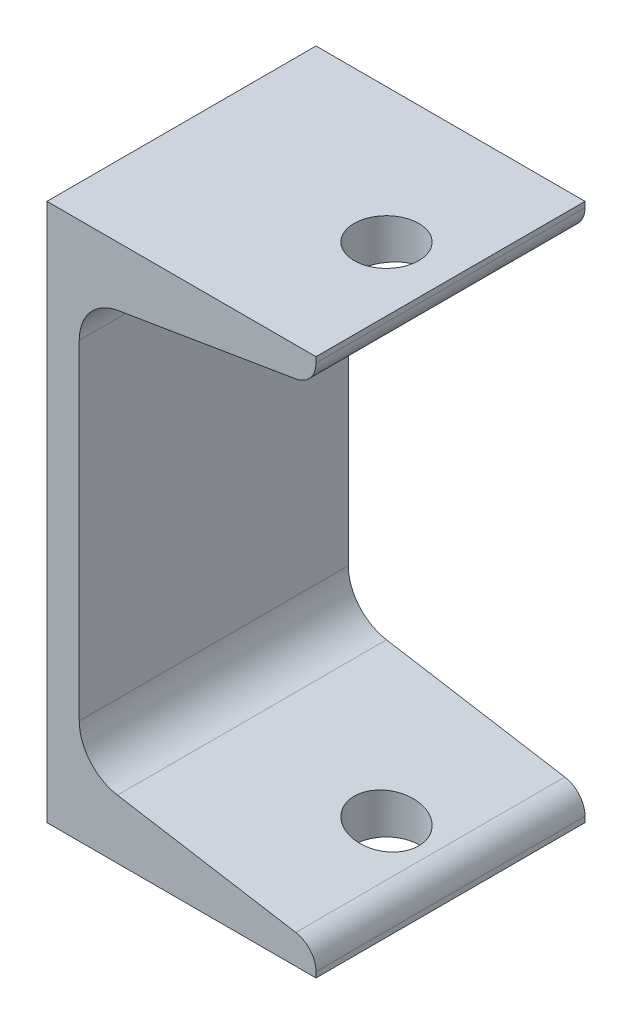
ISO-10303-21;
HEADER;
FILE_DESCRIPTION(('STEP AP214'),'2;1');
FILE_NAME('part.step','',(''),(''),'','','');
FILE_SCHEMA(('AUTOMOTIVE_DESIGN { 1 0 10303 214 1 1 1 1 }'));
ENDSEC;
DATA;
#1=APPLICATION_CONTEXT('core data for automotive mechanical design processes');
#2=APPLICATION_PROTOCOL_DEFINITION('international standard','automotive_design',2000,#1);
#3=PRODUCT_CONTEXT('',#1,'mechanical');
#4=PRODUCT('Part','Part','',(#3));
#5=PRODUCT_RELATED_PRODUCT_CATEGORY('part','',(#4));
#6=PRODUCT_DEFINITION_FORMATION('','',#4);
#7=PRODUCT_DEFINITION_CONTEXT('part definition',#1,'design');
#8=PRODUCT_DEFINITION('design','',#6,#7);
#9=PRODUCT_DEFINITION_SHAPE('','',#8);
#10=(LENGTH_UNIT() NAMED_UNIT(*) SI_UNIT(.MILLI.,.METRE.));
#11=(NAMED_UNIT(*) PLANE_ANGLE_UNIT() SI_UNIT($,.RADIAN.));
#12=(NAMED_UNIT(*) SI_UNIT($,.STERADIAN.) SOLID_ANGLE_UNIT());
#13=UNCERTAINTY_MEASURE_WITH_UNIT(LENGTH_MEASURE(1.E-05),#10,'distance_accuracy_value','');
#14=(GEOMETRIC_REPRESENTATION_CONTEXT(3) GLOBAL_UNCERTAINTY_ASSIGNED_CONTEXT((#13)) GLOBAL_UNIT_ASSIGNED_CONTEXT((#10,
#11,#12)) REPRESENTATION_CONTEXT('',''));
#15=CARTESIAN_POINT('',(0.,0.,0.));
#16=DIRECTION('',(0.,0.,1.));
#17=DIRECTION('',(1.,0.,0.));
#18=AXIS2_PLACEMENT_3D('',#15,#16,#17);
#19=CARTESIAN_POINT('',(0.,100.,25.));
#20=DIRECTION('',(1.,0.,0.));
#21=DIRECTION('',(0.,1.,0.));
#22=AXIS2_PLACEMENT_3D('',#19,#20,#21);
#23=PLANE('',#22);
#24=DIRECTION('',(0.,-1.,0.));
#25=VECTOR('',#24,1.);
#26=CARTESIAN_POINT('',(0.,100.,-25.));
#27=LINE('',#26,#25);
#28=CARTESIAN_POINT('',(0.,100.,-25.));
#29=VERTEX_POINT('',#28);
#30=CARTESIAN_POINT('',(0.,0.,-25.));
#31=VERTEX_POINT('',#30);
#32=EDGE_CURVE('E130',#29,#31,#27,.T.);
#33=ORIENTED_EDGE('',*,*,#32,.T.);
#34=DIRECTION('',(0.,0.,-1.));
#35=VECTOR('',#34,1.);
#36=CARTESIAN_POINT('',(0.,0.,25.));
#37=LINE('',#36,#35);
#38=CARTESIAN_POINT('',(0.,0.,25.));
#39=VERTEX_POINT('',#38);
#40=EDGE_CURVE('E116',#39,#31,#37,.T.);
#41=ORIENTED_EDGE('',*,*,#40,.F.);
#42=DIRECTION('',(0.,-1.,0.));
#43=VECTOR('',#42,1.);
#44=CARTESIAN_POINT('',(0.,100.,25.));
#45=LINE('',#44,#43);
#46=CARTESIAN_POINT('',(0.,100.,25.));
#47=VERTEX_POINT('',#46);
#48=EDGE_CURVE('E163',#47,#39,#45,.T.);
#49=ORIENTED_EDGE('',*,*,#48,.F.);
#50=DIRECTION('',(0.,0.,-1.));
#51=VECTOR('',#50,1.);
#52=CARTESIAN_POINT('',(0.,100.,25.));
#53=LINE('',#52,#51);
#54=EDGE_CURVE('E132',#47,#29,#53,.T.);
#55=ORIENTED_EDGE('',*,*,#54,.T.);
#56=EDGE_LOOP('',(#33,#41,#49,#55));
#57=FACE_BOUND('',#56,.T.);
#58=ADVANCED_FACE('F26',(#57),#23,.F.);
#59=CARTESIAN_POINT('',(50.,0.,25.));
#60=DIRECTION('',(0.,-1.,0.));
#61=DIRECTION('',(1.,0.,0.));
#62=AXIS2_PLACEMENT_3D('',#59,#60,#61);
#63=PLANE('',#62);
#64=CARTESIAN_POINT('',(38.1,0.,0.));
#65=DIRECTION('',(0.,-1.,0.));
#66=DIRECTION('',(1.,0.,0.));
#67=AXIS2_PLACEMENT_3D('',#64,#65,#66);
#68=CIRCLE('',#67,6.);
#69=CARTESIAN_POINT('',(44.1,0.,0.));
#70=VERTEX_POINT('',#69);
#71=EDGE_CURVE('E349',#70,#70,#68,.T.);
#72=ORIENTED_EDGE('',*,*,#71,.F.);
#73=EDGE_LOOP('',(#72));
#74=FACE_BOUND('',#73,.T.);
#75=DIRECTION('',(-1.,0.,0.));
#76=VECTOR('',#75,1.);
#77=CARTESIAN_POINT('',(50.,0.,-25.));
#78=LINE('',#77,#76);
#79=CARTESIAN_POINT('',(50.,0.,-25.));
#80=VERTEX_POINT('',#79);
#81=EDGE_CURVE('E120',#80,#31,#78,.T.);
#82=ORIENTED_EDGE('',*,*,#81,.F.);
#83=DIRECTION('',(0.,0.,-1.));
#84=VECTOR('',#83,1.);
#85=CARTESIAN_POINT('',(50.,0.,25.));
#86=LINE('',#85,#84);
#87=CARTESIAN_POINT('',(50.,0.,25.));
#88=VERTEX_POINT('',#87);
#89=EDGE_CURVE('E126',#88,#80,#86,.T.);
#90=ORIENTED_EDGE('',*,*,#89,.F.);
#91=DIRECTION('',(-1.,0.,0.));
#92=VECTOR('',#91,1.);
#93=CARTESIAN_POINT('',(50.,0.,25.));
#94=LINE('',#93,#92);
#95=EDGE_CURVE('E122',#88,#39,#94,.T.);
#96=ORIENTED_EDGE('',*,*,#95,.T.);
#97=ORIENTED_EDGE('',*,*,#40,.T.);
#98=EDGE_LOOP('',(#82,#90,#96,#97));
#99=FACE_BOUND('',#98,.T.);
#100=ADVANCED_FACE('F118',(#74,#99),#63,.T.);
#101=CARTESIAN_POINT('',(50.,0.,25.));
#102=DIRECTION('',(-1.,0.,0.));
#103=DIRECTION('',(0.,0.,1.));
#104=AXIS2_PLACEMENT_3D('',#101,#102,#103);
#105=PLANE('',#104);
#106=DIRECTION('',(0.,1.,0.));
#107=VECTOR('',#106,1.);
#108=CARTESIAN_POINT('',(50.,0.,-25.));
#109=LINE('',#108,#107);
#110=CARTESIAN_POINT('',(50.,1.02103967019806,-25.));
#111=VERTEX_POINT('',#110);
#112=EDGE_CURVE('E141',#80,#111,#109,.T.);
#113=ORIENTED_EDGE('',*,*,#112,.T.);
#114=DIRECTION('',(0.,0.,-1.));
#115=VECTOR('',#114,1.);
#116=CARTESIAN_POINT('',(50.,1.02103967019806,25.));
#117=LINE('',#116,#115);
#118=CARTESIAN_POINT('',(50.,1.02103967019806,25.));
#119=VERTEX_POINT('',#118);
#120=EDGE_CURVE('E205',#111,#119,#117,.F.);
#121=ORIENTED_EDGE('',*,*,#120,.T.);
#122=DIRECTION('',(0.,1.,0.));
#123=VECTOR('',#122,1.);
#124=CARTESIAN_POINT('',(50.,0.,25.));
#125=LINE('',#124,#123);
#126=EDGE_CURVE('E166',#88,#119,#125,.T.);
#127=ORIENTED_EDGE('',*,*,#126,.F.);
#128=ORIENTED_EDGE('',*,*,#89,.T.);
#129=EDGE_LOOP('',(#113,#121,#127,#128));
#130=FACE_BOUND('',#129,.T.);
#131=ADVANCED_FACE('F238',(#130),#105,.F.);
#132=CARTESIAN_POINT('',(13.1025094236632,10.983096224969,25.));
#133=DIRECTION('',(0.164410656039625,0.986391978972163,0.));
#134=DIRECTION('',(-0.986391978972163,0.164410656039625,0.));
#135=AXIS2_PLACEMENT_3D('',#132,#133,#134);
#136=PLANE('',#135);
#137=CARTESIAN_POINT('',(38.1,6.81654386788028,0.));
#138=DIRECTION('',(0.164410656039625,0.986391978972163,0.));
#139=DIRECTION('',(0.986391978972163,-0.164410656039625,0.));
#140=AXIS2_PLACEMENT_3D('',#137,#138,#139);
#141=ELLIPSE('',#140,6.08277452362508,6.);
#142=CARTESIAN_POINT('',(44.1,5.81647091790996,0.));
#143=VERTEX_POINT('',#142);
#144=EDGE_CURVE('E135',#143,#143,#141,.T.);
#145=ORIENTED_EDGE('',*,*,#144,.F.);
#146=EDGE_LOOP('',(#145));
#147=FACE_BOUND('',#146,.T.);
#148=DIRECTION('',(0.986391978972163,-0.164410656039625,0.));
#149=VECTOR('',#148,1.);
#150=CARTESIAN_POINT('',(13.1025094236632,10.983096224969,25.));
#151=LINE('',#150,#149);
#152=CARTESIAN_POINT('',(13.1025094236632,10.983096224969,25.));
#153=VERTEX_POINT('',#152);
#154=CARTESIAN_POINT('',(46.2398479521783,5.45980357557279,25.));
#155=VERTEX_POINT('',#154);
#156=EDGE_CURVE('E169',#153,#155,#151,.T.);
#157=ORIENTED_EDGE('',*,*,#156,.T.);
#158=DIRECTION('',(0.,0.,-1.));
#159=VECTOR('',#158,1.);
#160=CARTESIAN_POINT('',(46.2398479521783,5.45980357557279,-25.));
#161=LINE('',#160,#159);
#162=CARTESIAN_POINT('',(46.2398479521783,5.45980357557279,-25.));
#163=VERTEX_POINT('',#162);
#164=EDGE_CURVE('E125',#155,#163,#161,.T.);
#165=ORIENTED_EDGE('',*,*,#164,.T.);
#166=DIRECTION('',(0.986391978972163,-0.164410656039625,0.));
#167=VECTOR('',#166,1.);
#168=CARTESIAN_POINT('',(13.1025094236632,10.983096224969,-25.));
#169=LINE('',#168,#167);
#170=CARTESIAN_POINT('',(13.1025094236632,10.983096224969,-25.));
#171=VERTEX_POINT('',#170);
#172=EDGE_CURVE('E143',#171,#163,#169,.T.);
#173=ORIENTED_EDGE('',*,*,#172,.F.);
#174=DIRECTION('',(0.,0.,-1.));
#175=VECTOR('',#174,1.);
#176=CARTESIAN_POINT('',(13.1025094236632,10.983096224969,25.));
#177=LINE('',#176,#175);
#178=EDGE_CURVE('E196',#153,#171,#177,.T.);
#179=ORIENTED_EDGE('',*,*,#178,.F.);
#180=EDGE_LOOP('',(#157,#165,#173,#179));
#181=FACE_BOUND('',#180,.T.);
#182=ADVANCED_FACE('F245',(#147,#181),#136,.T.);
#183=CARTESIAN_POINT('',(14.5,19.3674280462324,25.));
#184=DIRECTION('',(0.,0.,-1.));
#185=DIRECTION('',(-1.,0.,0.));
#186=AXIS2_PLACEMENT_3D('',#183,#184,#185);
#187=CYLINDRICAL_SURFACE('',#186,8.5);
#188=CARTESIAN_POINT('',(14.5,19.3674280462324,-25.));
#189=DIRECTION('',(0.,0.,1.));
#190=DIRECTION('',(1.,0.,0.));
#191=AXIS2_PLACEMENT_3D('',#188,#189,#190);
#192=CIRCLE('',#191,8.5);
#193=CARTESIAN_POINT('',(5.99999999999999,19.3674280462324,-25.));
#194=VERTEX_POINT('',#193);
#195=EDGE_CURVE('E148',#194,#171,#192,.T.);
#196=ORIENTED_EDGE('',*,*,#195,.F.);
#197=DIRECTION('',(0.,0.,-1.));
#198=VECTOR('',#197,1.);
#199=CARTESIAN_POINT('',(5.99999999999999,19.3674280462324,25.));
#200=LINE('',#199,#198);
#201=CARTESIAN_POINT('',(5.99999999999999,19.3674280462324,25.));
#202=VERTEX_POINT('',#201);
#203=EDGE_CURVE('E194',#202,#194,#200,.T.);
#204=ORIENTED_EDGE('',*,*,#203,.F.);
#205=CARTESIAN_POINT('',(14.5,19.3674280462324,25.));
#206=DIRECTION('',(0.,0.,1.));
#207=DIRECTION('',(1.,0.,0.));
#208=AXIS2_PLACEMENT_3D('',#205,#206,#207);
#209=CIRCLE('',#208,8.5);
#210=EDGE_CURVE('E172',#202,#153,#209,.T.);
#211=ORIENTED_EDGE('',*,*,#210,.T.);
#212=ORIENTED_EDGE('',*,*,#178,.T.);
#213=EDGE_LOOP('',(#196,#204,#211,#212));
#214=FACE_BOUND('',#213,.T.);
#215=ADVANCED_FACE('F251',(#214),#187,.F.);
#216=CARTESIAN_POINT('',(5.99999999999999,80.6325719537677,25.));
#217=DIRECTION('',(1.,0.,0.));
#218=DIRECTION('',(0.,1.,0.));
#219=AXIS2_PLACEMENT_3D('',#216,#217,#218);
#220=PLANE('',#219);
#221=DIRECTION('',(0.,-1.,0.));
#222=VECTOR('',#221,1.);
#223=CARTESIAN_POINT('',(5.99999999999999,80.6325719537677,-25.));
#224=LINE('',#223,#222);
#225=CARTESIAN_POINT('',(5.99999999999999,80.6325719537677,-25.));
#226=VERTEX_POINT('',#225);
#227=EDGE_CURVE('E151',#226,#194,#224,.T.);
#228=ORIENTED_EDGE('',*,*,#227,.F.);
#229=DIRECTION('',(0.,0.,-1.));
#230=VECTOR('',#229,1.);
#231=CARTESIAN_POINT('',(5.99999999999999,80.6325719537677,25.));
#232=LINE('',#231,#230);
#233=CARTESIAN_POINT('',(5.99999999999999,80.6325719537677,25.));
#234=VERTEX_POINT('',#233);
#235=EDGE_CURVE('E192',#234,#226,#232,.T.);
#236=ORIENTED_EDGE('',*,*,#235,.F.);
#237=DIRECTION('',(0.,-1.,0.));
#238=VECTOR('',#237,1.);
#239=CARTESIAN_POINT('',(5.99999999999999,80.6325719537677,25.));
#240=LINE('',#239,#238);
#241=EDGE_CURVE('E175',#234,#202,#240,.T.);
#242=ORIENTED_EDGE('',*,*,#241,.T.);
#243=ORIENTED_EDGE('',*,*,#203,.T.);
#244=EDGE_LOOP('',(#228,#236,#242,#243));
#245=FACE_BOUND('',#244,.T.);
#246=ADVANCED_FACE('F254',(#245),#220,.T.);
#247=CARTESIAN_POINT('',(14.5,80.6325719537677,25.));
#248=DIRECTION('',(0.,0.,-1.));
#249=DIRECTION('',(-1.,0.,0.));
#250=AXIS2_PLACEMENT_3D('',#247,#248,#249);
#251=CYLINDRICAL_SURFACE('',#250,8.5);
#252=CARTESIAN_POINT('',(14.5,80.6325719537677,-25.));
#253=DIRECTION('',(0.,0.,-1.));
#254=DIRECTION('',(-1.,0.,0.));
#255=AXIS2_PLACEMENT_3D('',#252,#253,#254);
#256=CIRCLE('',#255,8.5);
#257=CARTESIAN_POINT('',(13.1025094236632,89.0169037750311,-25.));
#258=VERTEX_POINT('',#257);
#259=EDGE_CURVE('E154',#226,#258,#256,.T.);
#260=ORIENTED_EDGE('',*,*,#259,.T.);
#261=DIRECTION('',(0.,0.,-1.));
#262=VECTOR('',#261,1.);
#263=CARTESIAN_POINT('',(13.1025094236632,89.0169037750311,25.));
#264=LINE('',#263,#262);
#265=CARTESIAN_POINT('',(13.1025094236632,89.0169037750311,25.));
#266=VERTEX_POINT('',#265);
#267=EDGE_CURVE('E189',#266,#258,#264,.T.);
#268=ORIENTED_EDGE('',*,*,#267,.F.);
#269=CARTESIAN_POINT('',(14.5,80.6325719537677,25.));
#270=DIRECTION('',(0.,0.,-1.));
#271=DIRECTION('',(-1.,0.,0.));
#272=AXIS2_PLACEMENT_3D('',#269,#270,#271);
#273=CIRCLE('',#272,8.5);
#274=EDGE_CURVE('E178',#234,#266,#273,.T.);
#275=ORIENTED_EDGE('',*,*,#274,.F.);
#276=ORIENTED_EDGE('',*,*,#235,.T.);
#277=EDGE_LOOP('',(#260,#268,#275,#276));
#278=FACE_BOUND('',#277,.T.);
#279=ADVANCED_FACE('F258',(#278),#251,.F.);
#280=CARTESIAN_POINT('',(13.1025094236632,89.0169037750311,25.));
#281=DIRECTION('',(-0.164410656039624,0.986391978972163,0.));
#282=DIRECTION('',(-0.986391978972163,-0.164410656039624,0.));
#283=AXIS2_PLACEMENT_3D('',#280,#281,#282);
#284=PLANE('',#283);
#285=CARTESIAN_POINT('',(38.1,93.1834561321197,0.));
#286=DIRECTION('',(-0.164410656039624,0.986391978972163,0.));
#287=DIRECTION('',(-0.986391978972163,-0.164410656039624,0.));
#288=AXIS2_PLACEMENT_3D('',#285,#286,#287);
#289=ELLIPSE('',#288,6.08277452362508,6.);
#290=CARTESIAN_POINT('',(32.1,92.1833831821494,0.));
#291=VERTEX_POINT('',#290);
#292=EDGE_CURVE('E353',#291,#291,#289,.T.);
#293=ORIENTED_EDGE('',*,*,#292,.T.);
#294=EDGE_LOOP('',(#293));
#295=FACE_BOUND('',#294,.T.);
#296=DIRECTION('',(0.986391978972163,0.164410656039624,0.));
#297=VECTOR('',#296,1.);
#298=CARTESIAN_POINT('',(13.1025094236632,89.0169037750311,-25.));
#299=LINE('',#298,#297);
#300=CARTESIAN_POINT('',(46.2398479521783,94.5401964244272,-25.));
#301=VERTEX_POINT('',#300);
#302=EDGE_CURVE('E156',#258,#301,#299,.T.);
#303=ORIENTED_EDGE('',*,*,#302,.T.);
#304=DIRECTION('',(0.,0.,-1.));
#305=VECTOR('',#304,1.);
#306=CARTESIAN_POINT('',(46.2398479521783,94.5401964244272,25.));
#307=LINE('',#306,#305);
#308=CARTESIAN_POINT('',(46.2398479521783,94.5401964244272,25.));
#309=VERTEX_POINT('',#308);
#310=EDGE_CURVE('E11',#301,#309,#307,.F.);
#311=ORIENTED_EDGE('',*,*,#310,.T.);
#312=DIRECTION('',(0.986391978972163,0.164410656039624,0.));
#313=VECTOR('',#312,1.);
#314=CARTESIAN_POINT('',(13.1025094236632,89.0169037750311,25.));
#315=LINE('',#314,#313);
#316=EDGE_CURVE('E180',#266,#309,#315,.T.);
#317=ORIENTED_EDGE('',*,*,#316,.F.);
#318=ORIENTED_EDGE('',*,*,#267,.T.);
#319=EDGE_LOOP('',(#303,#311,#317,#318));
#320=FACE_BOUND('',#319,.T.);
#321=ADVANCED_FACE('F262',(#295,#320),#284,.F.);
#322=CARTESIAN_POINT('',(50.,100.,25.));
#323=DIRECTION('',(1.,0.,0.));
#324=DIRECTION('',(0.,1.,0.));
#325=AXIS2_PLACEMENT_3D('',#322,#323,#324);
#326=PLANE('',#325);
#327=DIRECTION('',(0.,-1.,0.));
#328=VECTOR('',#327,1.);
#329=CARTESIAN_POINT('',(50.,100.,25.));
#330=LINE('',#329,#328);
#331=CARTESIAN_POINT('',(50.,100.,25.));
#332=VERTEX_POINT('',#331);
#333=CARTESIAN_POINT('',(50.,98.9789603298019,25.));
#334=VERTEX_POINT('',#333);
#335=EDGE_CURVE('E182',#332,#334,#330,.T.);
#336=ORIENTED_EDGE('',*,*,#335,.T.);
#337=DIRECTION('',(0.,0.,-1.));
#338=VECTOR('',#337,1.);
#339=CARTESIAN_POINT('',(50.,98.9789603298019,-25.));
#340=LINE('',#339,#338);
#341=CARTESIAN_POINT('',(50.,98.9789603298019,-25.));
#342=VERTEX_POINT('',#341);
#343=EDGE_CURVE('E33',#334,#342,#340,.T.);
#344=ORIENTED_EDGE('',*,*,#343,.T.);
#345=DIRECTION('',(0.,-1.,0.));
#346=VECTOR('',#345,1.);
#347=CARTESIAN_POINT('',(50.,100.,-25.));
#348=LINE('',#347,#346);
#349=CARTESIAN_POINT('',(50.,100.,-25.));
#350=VERTEX_POINT('',#349);
#351=EDGE_CURVE('E158',#350,#342,#348,.T.);
#352=ORIENTED_EDGE('',*,*,#351,.F.);
#353=DIRECTION('',(0.,0.,-1.));
#354=VECTOR('',#353,1.);
#355=CARTESIAN_POINT('',(50.,100.,25.));
#356=LINE('',#355,#354);
#357=EDGE_CURVE('E187',#332,#350,#356,.T.);
#358=ORIENTED_EDGE('',*,*,#357,.F.);
#359=EDGE_LOOP('',(#336,#344,#352,#358));
#360=FACE_BOUND('',#359,.T.);
#361=ADVANCED_FACE('F213',(#360),#326,.T.);
#362=CARTESIAN_POINT('',(50.,100.,25.));
#363=DIRECTION('',(0.,-1.,0.));
#364=DIRECTION('',(1.,0.,0.));
#365=AXIS2_PLACEMENT_3D('',#362,#363,#364);
#366=PLANE('',#365);
#367=CARTESIAN_POINT('',(38.1,100.,0.));
#368=DIRECTION('',(0.,-1.,0.));
#369=DIRECTION('',(1.,0.,0.));
#370=AXIS2_PLACEMENT_3D('',#367,#368,#369);
#371=CIRCLE('',#370,6.);
#372=CARTESIAN_POINT('',(44.1,100.,0.));
#373=VERTEX_POINT('',#372);
#374=EDGE_CURVE('E350',#373,#373,#371,.T.);
#375=ORIENTED_EDGE('',*,*,#374,.T.);
#376=EDGE_LOOP('',(#375));
#377=FACE_BOUND('',#376,.T.);
#378=DIRECTION('',(-1.,0.,0.));
#379=VECTOR('',#378,1.);
#380=CARTESIAN_POINT('',(50.,100.,-25.));
#381=LINE('',#380,#379);
#382=EDGE_CURVE('E161',#350,#29,#381,.T.);
#383=ORIENTED_EDGE('',*,*,#382,.T.);
#384=ORIENTED_EDGE('',*,*,#54,.F.);
#385=DIRECTION('',(-1.,0.,0.));
#386=VECTOR('',#385,1.);
#387=CARTESIAN_POINT('',(50.,100.,25.));
#388=LINE('',#387,#386);
#389=EDGE_CURVE('E184',#332,#47,#388,.T.);
#390=ORIENTED_EDGE('',*,*,#389,.F.);
#391=ORIENTED_EDGE('',*,*,#357,.T.);
#392=EDGE_LOOP('',(#383,#384,#390,#391));
#393=FACE_BOUND('',#392,.T.);
#394=ADVANCED_FACE('F217',(#377,#393),#366,.F.);
#395=CARTESIAN_POINT('',(14.5,19.3674280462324,25.));
#396=DIRECTION('',(0.,0.,1.));
#397=DIRECTION('',(1.,0.,0.));
#398=AXIS2_PLACEMENT_3D('',#395,#396,#397);
#399=PLANE('',#398);
#400=ORIENTED_EDGE('',*,*,#126,.T.);
#401=CARTESIAN_POINT('',(45.5,1.02103967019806,25.));
#402=DIRECTION('',(0.,0.,1.));
#403=DIRECTION('',(1.,0.,0.));
#404=AXIS2_PLACEMENT_3D('',#401,#402,#403);
#405=CIRCLE('',#404,4.5);
#406=EDGE_CURVE('E208',#119,#155,#405,.T.);
#407=ORIENTED_EDGE('',*,*,#406,.T.);
#408=ORIENTED_EDGE('',*,*,#156,.F.);
#409=ORIENTED_EDGE('',*,*,#210,.F.);
#410=ORIENTED_EDGE('',*,*,#241,.F.);
#411=ORIENTED_EDGE('',*,*,#274,.T.);
#412=ORIENTED_EDGE('',*,*,#316,.T.);
#413=CARTESIAN_POINT('',(45.5,98.9789603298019,25.));
#414=DIRECTION('',(0.,0.,1.));
#415=DIRECTION('',(1.,0.,0.));
#416=AXIS2_PLACEMENT_3D('',#413,#414,#415);
#417=CIRCLE('',#416,4.5);
#418=EDGE_CURVE('E40',#309,#334,#417,.T.);
#419=ORIENTED_EDGE('',*,*,#418,.T.);
#420=ORIENTED_EDGE('',*,*,#335,.F.);
#421=ORIENTED_EDGE('',*,*,#389,.T.);
#422=ORIENTED_EDGE('',*,*,#48,.T.);
#423=ORIENTED_EDGE('',*,*,#95,.F.);
#424=EDGE_LOOP('',(#400,#407,#408,#409,#410,#411,#412,#419,#420,#421,#422,#423));
#425=FACE_BOUND('',#424,.T.);
#426=ADVANCED_FACE('F219',(#425),#399,.T.);
#427=CARTESIAN_POINT('',(14.5,19.3674280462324,-25.));
#428=DIRECTION('',(0.,0.,1.));
#429=DIRECTION('',(1.,0.,0.));
#430=AXIS2_PLACEMENT_3D('',#427,#428,#429);
#431=PLANE('',#430);
#432=ORIENTED_EDGE('',*,*,#172,.T.);
#433=CARTESIAN_POINT('',(45.5,1.02103967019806,-25.));
#434=DIRECTION('',(0.,0.,1.));
#435=DIRECTION('',(1.,0.,0.));
#436=AXIS2_PLACEMENT_3D('',#433,#434,#435);
#437=CIRCLE('',#436,4.5);
#438=EDGE_CURVE('E203',#163,#111,#437,.F.);
#439=ORIENTED_EDGE('',*,*,#438,.T.);
#440=ORIENTED_EDGE('',*,*,#112,.F.);
#441=ORIENTED_EDGE('',*,*,#81,.T.);
#442=ORIENTED_EDGE('',*,*,#32,.F.);
#443=ORIENTED_EDGE('',*,*,#382,.F.);
#444=ORIENTED_EDGE('',*,*,#351,.T.);
#445=CARTESIAN_POINT('',(45.5,98.9789603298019,-25.));
#446=DIRECTION('',(0.,0.,1.));
#447=DIRECTION('',(1.,0.,0.));
#448=AXIS2_PLACEMENT_3D('',#445,#446,#447);
#449=CIRCLE('',#448,4.5);
#450=EDGE_CURVE('E201',#342,#301,#449,.F.);
#451=ORIENTED_EDGE('',*,*,#450,.T.);
#452=ORIENTED_EDGE('',*,*,#302,.F.);
#453=ORIENTED_EDGE('',*,*,#259,.F.);
#454=ORIENTED_EDGE('',*,*,#227,.T.);
#455=ORIENTED_EDGE('',*,*,#195,.T.);
#456=EDGE_LOOP('',(#432,#439,#440,#441,#442,#443,#444,#451,#452,#453,#454,#455));
#457=FACE_BOUND('',#456,.T.);
#458=ADVANCED_FACE('F139',(#457),#431,.F.);
#459=CARTESIAN_POINT('',(45.5,1.02103967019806,25.));
#460=DIRECTION('',(0.,0.,1.));
#461=DIRECTION('',(1.,0.,0.));
#462=AXIS2_PLACEMENT_3D('',#459,#460,#461);
#463=CYLINDRICAL_SURFACE('',#462,4.5);
#464=ORIENTED_EDGE('',*,*,#406,.F.);
#465=ORIENTED_EDGE('',*,*,#120,.F.);
#466=ORIENTED_EDGE('',*,*,#438,.F.);
#467=ORIENTED_EDGE('',*,*,#164,.F.);
#468=EDGE_LOOP('',(#464,#465,#466,#467));
#469=FACE_BOUND('',#468,.T.);
#470=ADVANCED_FACE('F228',(#469),#463,.T.);
#471=CARTESIAN_POINT('',(45.5,98.9789603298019,25.));
#472=DIRECTION('',(0.,0.,1.));
#473=DIRECTION('',(1.,0.,0.));
#474=AXIS2_PLACEMENT_3D('',#471,#472,#473);
#475=CYLINDRICAL_SURFACE('',#474,4.5);
#476=ORIENTED_EDGE('',*,*,#418,.F.);
#477=ORIENTED_EDGE('',*,*,#310,.F.);
#478=ORIENTED_EDGE('',*,*,#450,.F.);
#479=ORIENTED_EDGE('',*,*,#343,.F.);
#480=EDGE_LOOP('',(#476,#477,#478,#479));
#481=FACE_BOUND('',#480,.T.);
#482=ADVANCED_FACE('F305',(#481),#475,.T.);
#483=CARTESIAN_POINT('',(38.1,100.,0.));
#484=DIRECTION('',(0.,-1.,0.));
#485=DIRECTION('',(1.,0.,0.));
#486=AXIS2_PLACEMENT_3D('',#483,#484,#485);
#487=CYLINDRICAL_SURFACE('',#486,6.);
#488=ORIENTED_EDGE('',*,*,#374,.F.);
#489=EDGE_LOOP('',(#488));
#490=FACE_BOUND('',#489,.T.);
#491=ORIENTED_EDGE('',*,*,#292,.F.);
#492=EDGE_LOOP('',(#491));
#493=FACE_BOUND('',#492,.T.);
#494=ADVANCED_FACE('F300',(#490,#493),#487,.F.);
#495=ORIENTED_EDGE('',*,*,#144,.T.);
#496=EDGE_LOOP('',(#495));
#497=FACE_BOUND('',#496,.T.);
#498=ORIENTED_EDGE('',*,*,#71,.T.);
#499=EDGE_LOOP('',(#498));
#500=FACE_BOUND('',#499,.T.);
#501=ADVANCED_FACE('F304',(#497,#500),#487,.F.);
#502=CLOSED_SHELL('',(#58,#100,#131,#182,#215,#246,#279,#321,#361,#394,#426,#458,#470,#482,#494,#501));
#503=MANIFOLD_SOLID_BREP('B2',#502);
#504=ADVANCED_BREP_SHAPE_REPRESENTATION('',(#18,#503),#14);
#505=SHAPE_DEFINITION_REPRESENTATION(#9,#504);
ENDSEC;
END-ISO-10303-21;
